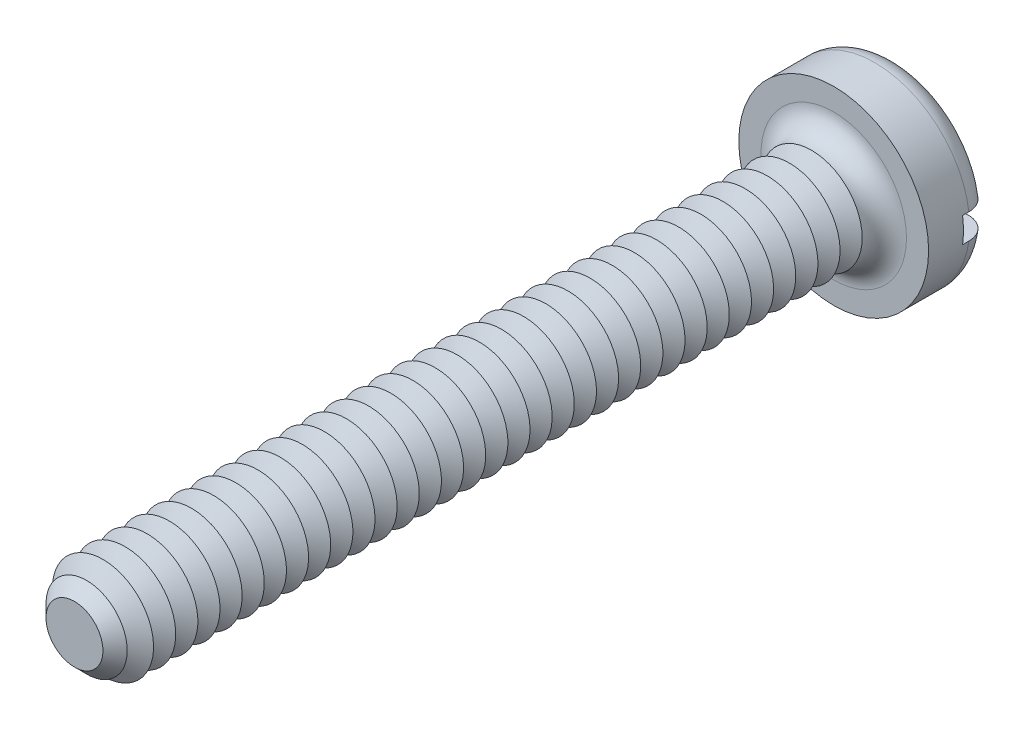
from build123d import *

# Parameters (mm, degrees)
SKETCH3_R           = 1.5
BOSS_EXTRUDE2_DEPTH = 1
SKETCH4_R           = 0.8
BOSS_EXTRUDE3_DEPTH = 12
FILLET1_R           = 0.35
CHAMFER1_SIZE       = 0.35
LPATTERN1_COUNT     = 33
LPATTERN1_PITCH     = 0.35
SKETCH8_W           = 3
SKETCH8_H           = 0.4
CUT_EXTRUDE1_DEPTH  = 0.45


with BuildPart() as part:
    # Sketch3 → Boss-Extrude2 (new body)
    with BuildSketch(Plane.XY):
        Circle(SKETCH3_R)
    extrude(amount=-BOSS_EXTRUDE2_DEPTH)

    # Sketch4 → Boss-Extrude3 (add)
    with BuildSketch(Plane.XY):
        Circle(SKETCH4_R)
    extrude(amount=BOSS_EXTRUDE3_DEPTH)

    # Fillet1
    fillet1_edges = [part.edges().sort_by_distance(p)[0] for p in [
        (-1.5, 0, -1),
        (-0.8, 0, 0),
    ]]
    fillet(fillet1_edges, radius=FILLET1_R)

    # Chamfer1
    chamfer1_edges = [part.edges().sort_by_distance(p)[0] for p in [
        (-0.8, 0, 12),
    ]]
    chamfer(chamfer1_edges, length=CHAMFER1_SIZE)

    # Sketch6 → Cut-Revolve1 (revolve, cut)
    with BuildSketch(Plane(origin=(0, 0, 0), x_dir=(0, 0, -1), z_dir=(1, 0, 0)), mode=Mode.PRIVATE) as cut_revolve1_sk:
        Polygon((-0.35, 0.8), (-0.525, 0.496891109), (-0.7, 0.8), align=None)
    cut_revolve1 = revolve(cut_revolve1_sk.sketch.rotate(Axis((0, 0, -1.694361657), (0, 0, 1)), 90), axis=Axis((0, 0, -1.694361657), (0, 0, 1)), mode=Mode.SUBTRACT)

    # LPattern1: Cut-Revolve1 ×33
    with Locations(*[(0, 0, i * LPATTERN1_PITCH) for i in range(1, LPATTERN1_COUNT)]):
        add(cut_revolve1, mode=Mode.SUBTRACT)

    # Sketch8 → Cut-Extrude1 (cut)
    with BuildSketch(Plane(origin=(0, 0, -1), x_dir=(-1, 0, 0), z_dir=(0, 0, -1))):
        Rectangle(SKETCH8_W, SKETCH8_H)
    extrude(amount=-CUT_EXTRUDE1_DEPTH, mode=Mode.SUBTRACT)


solid = part.part
